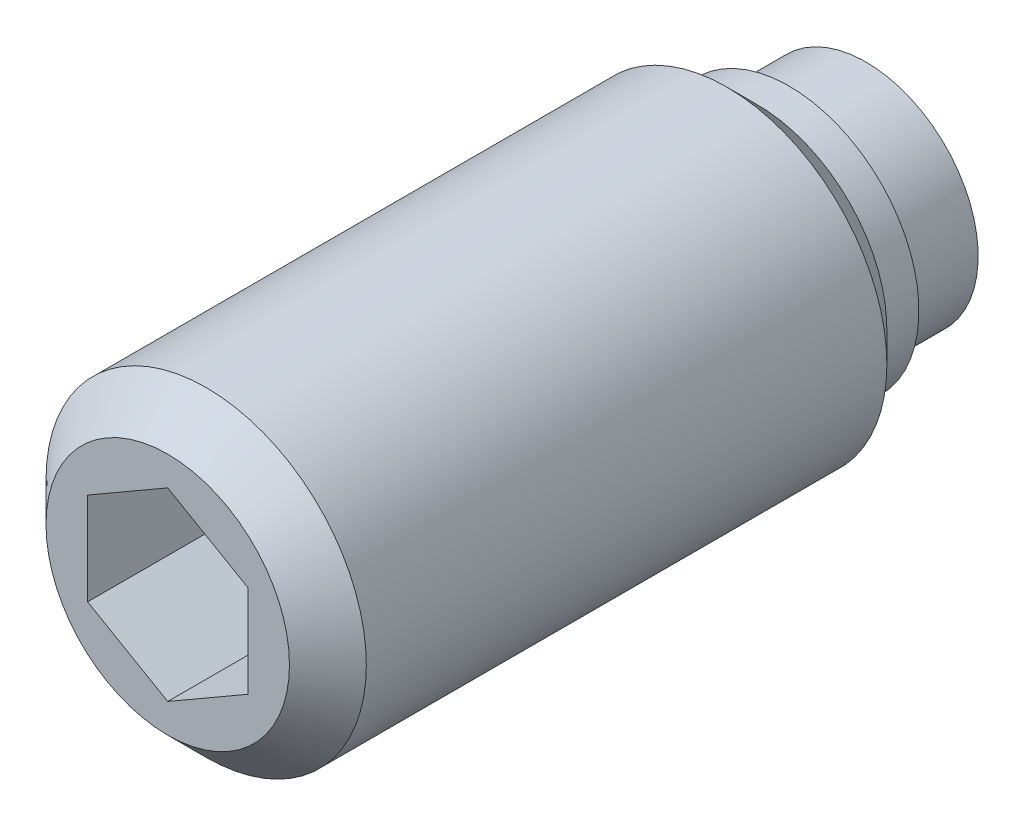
ISO-10303-21;
HEADER;
FILE_DESCRIPTION(('STEP AP214'),'2;1');
FILE_NAME('part.step','',(''),(''),'','','');
FILE_SCHEMA(('AUTOMOTIVE_DESIGN { 1 0 10303 214 1 1 1 1 }'));
ENDSEC;
DATA;
#1=APPLICATION_CONTEXT('core data for automotive mechanical design processes');
#2=APPLICATION_PROTOCOL_DEFINITION('international standard','automotive_design',2000,#1);
#3=PRODUCT_CONTEXT('',#1,'mechanical');
#4=PRODUCT('Part','Part','',(#3));
#5=PRODUCT_RELATED_PRODUCT_CATEGORY('part','',(#4));
#6=PRODUCT_DEFINITION_FORMATION('','',#4);
#7=PRODUCT_DEFINITION_CONTEXT('part definition',#1,'design');
#8=PRODUCT_DEFINITION('design','',#6,#7);
#9=PRODUCT_DEFINITION_SHAPE('','',#8);
#10=(LENGTH_UNIT() NAMED_UNIT(*) SI_UNIT(.MILLI.,.METRE.));
#11=(NAMED_UNIT(*) PLANE_ANGLE_UNIT() SI_UNIT($,.RADIAN.));
#12=(NAMED_UNIT(*) SI_UNIT($,.STERADIAN.) SOLID_ANGLE_UNIT());
#13=UNCERTAINTY_MEASURE_WITH_UNIT(LENGTH_MEASURE(1.E-05),#10,'distance_accuracy_value','');
#14=(GEOMETRIC_REPRESENTATION_CONTEXT(3) GLOBAL_UNCERTAINTY_ASSIGNED_CONTEXT((#13)) GLOBAL_UNIT_ASSIGNED_CONTEXT((#10,
#11,#12)) REPRESENTATION_CONTEXT('',''));
#15=CARTESIAN_POINT('',(0.,0.,0.));
#16=DIRECTION('',(0.,0.,1.));
#17=DIRECTION('',(1.,0.,0.));
#18=AXIS2_PLACEMENT_3D('',#15,#16,#17);
#19=CARTESIAN_POINT('',(0.,4.05,3.5));
#20=DIRECTION('',(0.,0.,1.));
#21=DIRECTION('',(1.,0.,0.));
#22=AXIS2_PLACEMENT_3D('',#19,#20,#21);
#23=PLANE('',#22);
#24=CARTESIAN_POINT('',(0.,0.,3.5));
#25=DIRECTION('',(0.,0.,-1.));
#26=DIRECTION('',(-1.,0.,0.));
#27=AXIS2_PLACEMENT_3D('',#24,#25,#26);
#28=CIRCLE('',#27,3.5);
#29=CARTESIAN_POINT('',(-3.50000000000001,0.,3.5));
#30=VERTEX_POINT('',#29);
#31=EDGE_CURVE('E124',#30,#30,#28,.T.);
#32=ORIENTED_EDGE('',*,*,#31,.F.);
#33=EDGE_LOOP('',(#32));
#34=FACE_BOUND('',#33,.T.);
#35=CARTESIAN_POINT('',(0.,0.,3.5));
#36=DIRECTION('',(0.,0.,-1.));
#37=DIRECTION('',(-1.,0.,0.));
#38=AXIS2_PLACEMENT_3D('',#35,#36,#37);
#39=CIRCLE('',#38,4.05);
#40=CARTESIAN_POINT('',(-4.05000000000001,0.,3.5));
#41=VERTEX_POINT('',#40);
#42=EDGE_CURVE('E127',#41,#41,#39,.T.);
#43=ORIENTED_EDGE('',*,*,#42,.T.);
#44=EDGE_LOOP('',(#43));
#45=FACE_BOUND('',#44,.T.);
#46=ADVANCED_FACE('F14',(#34,#45),#23,.F.);
#47=CARTESIAN_POINT('',(0.,0.,3.5));
#48=DIRECTION('',(0.,0.,-1.));
#49=DIRECTION('',(-1.,0.,0.));
#50=AXIS2_PLACEMENT_3D('',#47,#48,#49);
#51=CYLINDRICAL_SURFACE('',#50,5.);
#52=CARTESIAN_POINT('',(0.,0.,21.7));
#53=DIRECTION('',(0.,0.,1.));
#54=DIRECTION('',(1.,0.,0.));
#55=AXIS2_PLACEMENT_3D('',#52,#53,#54);
#56=CIRCLE('',#55,5.);
#57=CARTESIAN_POINT('',(4.99999999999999,0.,21.7));
#58=VERTEX_POINT('',#57);
#59=EDGE_CURVE('E9',#58,#58,#56,.F.);
#60=ORIENTED_EDGE('',*,*,#59,.T.);
#61=EDGE_LOOP('',(#60));
#62=FACE_BOUND('',#61,.T.);
#63=CARTESIAN_POINT('',(0.,0.,5.45));
#64=DIRECTION('',(0.,0.,-1.));
#65=DIRECTION('',(-1.,0.,0.));
#66=AXIS2_PLACEMENT_3D('',#63,#64,#65);
#67=CIRCLE('',#66,5.);
#68=CARTESIAN_POINT('',(-5.00000000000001,0.,5.45));
#69=VERTEX_POINT('',#68);
#70=EDGE_CURVE('E133',#69,#69,#67,.T.);
#71=ORIENTED_EDGE('',*,*,#70,.F.);
#72=EDGE_LOOP('',(#71));
#73=FACE_BOUND('',#72,.T.);
#74=ADVANCED_FACE('F151',(#62,#73),#51,.T.);
#75=CARTESIAN_POINT('',(0.,0.,5.45));
#76=DIRECTION('',(0.,0.,1.));
#77=DIRECTION('',(1.,0.,0.));
#78=AXIS2_PLACEMENT_3D('',#75,#76,#77);
#79=CONICAL_SURFACE('',#78,5.,0.785398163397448);
#80=CARTESIAN_POINT('',(0.,0.,4.5));
#81=DIRECTION('',(0.,0.,-1.));
#82=DIRECTION('',(-1.,0.,0.));
#83=AXIS2_PLACEMENT_3D('',#80,#81,#82);
#84=CIRCLE('',#83,4.05);
#85=CARTESIAN_POINT('',(-4.05000000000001,0.,4.5));
#86=VERTEX_POINT('',#85);
#87=EDGE_CURVE('E130',#86,#86,#84,.T.);
#88=ORIENTED_EDGE('',*,*,#87,.F.);
#89=EDGE_LOOP('',(#88));
#90=FACE_BOUND('',#89,.T.);
#91=ORIENTED_EDGE('',*,*,#70,.T.);
#92=EDGE_LOOP('',(#91));
#93=FACE_BOUND('',#92,.T.);
#94=ADVANCED_FACE('F158',(#90,#93),#79,.T.);
#95=CARTESIAN_POINT('',(0.,0.,3.5));
#96=DIRECTION('',(0.,0.,-1.));
#97=DIRECTION('',(-1.,0.,0.));
#98=AXIS2_PLACEMENT_3D('',#95,#96,#97);
#99=CYLINDRICAL_SURFACE('',#98,4.05);
#100=ORIENTED_EDGE('',*,*,#42,.F.);
#101=EDGE_LOOP('',(#100));
#102=FACE_BOUND('',#101,.T.);
#103=ORIENTED_EDGE('',*,*,#87,.T.);
#104=EDGE_LOOP('',(#103));
#105=FACE_BOUND('',#104,.T.);
#106=ADVANCED_FACE('F166',(#102,#105),#99,.T.);
#107=CARTESIAN_POINT('',(0.,0.,0.));
#108=DIRECTION('',(0.,0.,-1.));
#109=DIRECTION('',(-1.,0.,0.));
#110=AXIS2_PLACEMENT_3D('',#107,#108,#109);
#111=CYLINDRICAL_SURFACE('',#110,3.5);
#112=CARTESIAN_POINT('',(0.,0.,1.1));
#113=DIRECTION('',(0.,0.,-1.));
#114=DIRECTION('',(-1.,0.,0.));
#115=AXIS2_PLACEMENT_3D('',#112,#113,#114);
#116=CIRCLE('',#115,3.5);
#117=CARTESIAN_POINT('',(-3.50000000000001,0.,1.1));
#118=VERTEX_POINT('',#117);
#119=EDGE_CURVE('E114',#118,#118,#116,.T.);
#120=ORIENTED_EDGE('',*,*,#119,.F.);
#121=EDGE_LOOP('',(#120));
#122=FACE_BOUND('',#121,.T.);
#123=ORIENTED_EDGE('',*,*,#31,.T.);
#124=EDGE_LOOP('',(#123));
#125=FACE_BOUND('',#124,.T.);
#126=ADVANCED_FACE('F164',(#122,#125),#111,.T.);
#127=CARTESIAN_POINT('',(-0.0371790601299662,0.,5.9998848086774));
#128=DIRECTION('',(0.,-1.,0.));
#129=DIRECTION('',(-1.,0.,0.));
#130=AXIS2_PLACEMENT_3D('',#127,#128,#129);
#131=CIRCLE('',#130,5.99999999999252);
#132=TRIMMED_CURVE('',#131,(PARAMETER_VALUE(-1.57699287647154)),
(PARAMETER_VALUE(1.57699287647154)),.T.,.PARAMETER.);
#133=CARTESIAN_POINT('',(0.,0.,5.9998848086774));
#134=DIRECTION('',(0.,0.,-1.));
#135=AXIS1_PLACEMENT('',#133,#134);
#136=SURFACE_OF_REVOLUTION('',#132,#135);
#137=ORIENTED_EDGE('',*,*,#119,.T.);
#138=EDGE_LOOP('',(#137));
#139=FACE_BOUND('',#138,.T.);
#140=CARTESIAN_POINT('',(0.,0.,0.));
#141=VERTEX_POINT('',#140);
#142=VERTEX_LOOP('',#141);
#143=FACE_BOUND('',#142,.T.);
#144=ADVANCED_FACE('F198',(#139,#143),#136,.T.);
#145=CARTESIAN_POINT('',(0.,0.,22.9));
#146=DIRECTION('',(0.,0.,1.));
#147=DIRECTION('',(1.,0.,0.));
#148=AXIS2_PLACEMENT_3D('',#145,#146,#147);
#149=PLANE('',#148);
#150=CARTESIAN_POINT('',(0.,0.,22.9));
#151=DIRECTION('',(0.,0.,1.));
#152=DIRECTION('',(1.,0.,0.));
#153=AXIS2_PLACEMENT_3D('',#150,#151,#152);
#154=CIRCLE('',#153,3.8);
#155=CARTESIAN_POINT('',(3.79999999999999,0.,22.9));
#156=VERTEX_POINT('',#155);
#157=EDGE_CURVE('E22',#156,#156,#154,.T.);
#158=ORIENTED_EDGE('',*,*,#157,.T.);
#159=EDGE_LOOP('',(#158));
#160=FACE_BOUND('',#159,.T.);
#161=DIRECTION('',(-0.866025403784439,0.5,0.));
#162=VECTOR('',#161,1.);
#163=CARTESIAN_POINT('',(2.5,1.44337567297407,22.9));
#164=LINE('',#163,#162);
#165=CARTESIAN_POINT('',(2.5,1.44337567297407,22.9));
#166=VERTEX_POINT('',#165);
#167=CARTESIAN_POINT('',(0.,2.88675134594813,22.9));
#168=VERTEX_POINT('',#167);
#169=EDGE_CURVE('E29',#166,#168,#164,.T.);
#170=ORIENTED_EDGE('',*,*,#169,.F.);
#171=DIRECTION('',(0.,1.,0.));
#172=VECTOR('',#171,1.);
#173=CARTESIAN_POINT('',(2.5,-1.44337567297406,22.9));
#174=LINE('',#173,#172);
#175=CARTESIAN_POINT('',(2.5,-1.44337567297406,22.9));
#176=VERTEX_POINT('',#175);
#177=EDGE_CURVE('E88',#176,#166,#174,.T.);
#178=ORIENTED_EDGE('',*,*,#177,.F.);
#179=DIRECTION('',(0.866025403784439,0.5,0.));
#180=VECTOR('',#179,1.);
#181=CARTESIAN_POINT('',(0.,-2.88675134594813,22.9));
#182=LINE('',#181,#180);
#183=CARTESIAN_POINT('',(0.,-2.88675134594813,22.9));
#184=VERTEX_POINT('',#183);
#185=EDGE_CURVE('E91',#184,#176,#182,.T.);
#186=ORIENTED_EDGE('',*,*,#185,.F.);
#187=DIRECTION('',(0.866025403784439,-0.5,0.));
#188=VECTOR('',#187,1.);
#189=CARTESIAN_POINT('',(-2.5,-1.44337567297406,22.9));
#190=LINE('',#189,#188);
#191=CARTESIAN_POINT('',(-2.5,-1.44337567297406,22.9));
#192=VERTEX_POINT('',#191);
#193=EDGE_CURVE('E107',#192,#184,#190,.T.);
#194=ORIENTED_EDGE('',*,*,#193,.F.);
#195=DIRECTION('',(0.,-1.,0.));
#196=VECTOR('',#195,1.);
#197=CARTESIAN_POINT('',(-2.5,1.44337567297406,22.9));
#198=LINE('',#197,#196);
#199=CARTESIAN_POINT('',(-2.5,1.44337567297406,22.9));
#200=VERTEX_POINT('',#199);
#201=EDGE_CURVE('E104',#200,#192,#198,.T.);
#202=ORIENTED_EDGE('',*,*,#201,.F.);
#203=DIRECTION('',(-0.866025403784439,-0.5,0.));
#204=VECTOR('',#203,1.);
#205=CARTESIAN_POINT('',(0.,2.88675134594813,22.9));
#206=LINE('',#205,#204);
#207=EDGE_CURVE('E102',#168,#200,#206,.T.);
#208=ORIENTED_EDGE('',*,*,#207,.F.);
#209=EDGE_LOOP('',(#170,#178,#186,#194,#202,#208));
#210=FACE_BOUND('',#209,.T.);
#211=ADVANCED_FACE('F138',(#160,#210),#149,.T.);
#212=CARTESIAN_POINT('',(2.5,1.44337567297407,16.9));
#213=DIRECTION('',(0.5,0.866025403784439,0.));
#214=DIRECTION('',(-0.866025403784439,0.5,0.));
#215=AXIS2_PLACEMENT_3D('',#212,#213,#214);
#216=PLANE('',#215);
#217=ORIENTED_EDGE('',*,*,#169,.T.);
#218=DIRECTION('',(0.,0.,1.));
#219=VECTOR('',#218,1.);
#220=CARTESIAN_POINT('',(0.,2.88675134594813,16.9));
#221=LINE('',#220,#219);
#222=CARTESIAN_POINT('',(0.,2.88675134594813,16.9));
#223=VERTEX_POINT('',#222);
#224=EDGE_CURVE('E65',#223,#168,#221,.T.);
#225=ORIENTED_EDGE('',*,*,#224,.F.);
#226=DIRECTION('',(-0.866025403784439,0.5,0.));
#227=VECTOR('',#226,1.);
#228=CARTESIAN_POINT('',(2.5,1.44337567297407,16.9));
#229=LINE('',#228,#227);
#230=CARTESIAN_POINT('',(2.5,1.44337567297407,16.9));
#231=VERTEX_POINT('',#230);
#232=EDGE_CURVE('E69',#231,#223,#229,.T.);
#233=ORIENTED_EDGE('',*,*,#232,.F.);
#234=DIRECTION('',(0.,0.,1.));
#235=VECTOR('',#234,1.);
#236=CARTESIAN_POINT('',(2.5,1.44337567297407,16.9));
#237=LINE('',#236,#235);
#238=EDGE_CURVE('E112',#231,#166,#237,.T.);
#239=ORIENTED_EDGE('',*,*,#238,.T.);
#240=EDGE_LOOP('',(#217,#225,#233,#239));
#241=FACE_BOUND('',#240,.T.);
#242=ADVANCED_FACE('F67',(#241),#216,.F.);
#243=CARTESIAN_POINT('',(2.5,-1.44337567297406,16.9));
#244=DIRECTION('',(1.,0.,0.));
#245=DIRECTION('',(0.,0.,-1.));
#246=AXIS2_PLACEMENT_3D('',#243,#244,#245);
#247=PLANE('',#246);
#248=ORIENTED_EDGE('',*,*,#177,.T.);
#249=ORIENTED_EDGE('',*,*,#238,.F.);
#250=DIRECTION('',(0.,1.,0.));
#251=VECTOR('',#250,1.);
#252=CARTESIAN_POINT('',(2.5,-1.44337567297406,16.9));
#253=LINE('',#252,#251);
#254=CARTESIAN_POINT('',(2.5,-1.44337567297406,16.9));
#255=VERTEX_POINT('',#254);
#256=EDGE_CURVE('E75',#255,#231,#253,.T.);
#257=ORIENTED_EDGE('',*,*,#256,.F.);
#258=DIRECTION('',(0.,0.,1.));
#259=VECTOR('',#258,1.);
#260=CARTESIAN_POINT('',(2.5,-1.44337567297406,16.9));
#261=LINE('',#260,#259);
#262=EDGE_CURVE('E115',#255,#176,#261,.T.);
#263=ORIENTED_EDGE('',*,*,#262,.T.);
#264=EDGE_LOOP('',(#248,#249,#257,#263));
#265=FACE_BOUND('',#264,.T.);
#266=ADVANCED_FACE('F220',(#265),#247,.F.);
#267=CARTESIAN_POINT('',(0.,-2.88675134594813,16.9));
#268=DIRECTION('',(0.5,-0.866025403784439,0.));
#269=DIRECTION('',(0.866025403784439,0.5,0.));
#270=AXIS2_PLACEMENT_3D('',#267,#268,#269);
#271=PLANE('',#270);
#272=ORIENTED_EDGE('',*,*,#185,.T.);
#273=ORIENTED_EDGE('',*,*,#262,.F.);
#274=DIRECTION('',(0.866025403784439,0.5,0.));
#275=VECTOR('',#274,1.);
#276=CARTESIAN_POINT('',(0.,-2.88675134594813,16.9));
#277=LINE('',#276,#275);
#278=CARTESIAN_POINT('',(0.,-2.88675134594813,16.9));
#279=VERTEX_POINT('',#278);
#280=EDGE_CURVE('E98',#279,#255,#277,.T.);
#281=ORIENTED_EDGE('',*,*,#280,.F.);
#282=DIRECTION('',(0.,0.,1.));
#283=VECTOR('',#282,1.);
#284=CARTESIAN_POINT('',(0.,-2.88675134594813,16.9));
#285=LINE('',#284,#283);
#286=EDGE_CURVE('E117',#279,#184,#285,.T.);
#287=ORIENTED_EDGE('',*,*,#286,.T.);
#288=EDGE_LOOP('',(#272,#273,#281,#287));
#289=FACE_BOUND('',#288,.T.);
#290=ADVANCED_FACE('F228',(#289),#271,.F.);
#291=CARTESIAN_POINT('',(-2.5,-1.44337567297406,16.9));
#292=DIRECTION('',(-0.5,-0.866025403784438,0.));
#293=DIRECTION('',(0.866025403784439,-0.5,0.));
#294=AXIS2_PLACEMENT_3D('',#291,#292,#293);
#295=PLANE('',#294);
#296=ORIENTED_EDGE('',*,*,#193,.T.);
#297=ORIENTED_EDGE('',*,*,#286,.F.);
#298=DIRECTION('',(0.866025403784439,-0.5,0.));
#299=VECTOR('',#298,1.);
#300=CARTESIAN_POINT('',(-2.5,-1.44337567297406,16.9));
#301=LINE('',#300,#299);
#302=CARTESIAN_POINT('',(-2.5,-1.44337567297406,16.9));
#303=VERTEX_POINT('',#302);
#304=EDGE_CURVE('E95',#303,#279,#301,.T.);
#305=ORIENTED_EDGE('',*,*,#304,.F.);
#306=DIRECTION('',(0.,0.,1.));
#307=VECTOR('',#306,1.);
#308=CARTESIAN_POINT('',(-2.5,-1.44337567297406,16.9));
#309=LINE('',#308,#307);
#310=EDGE_CURVE('E119',#303,#192,#309,.T.);
#311=ORIENTED_EDGE('',*,*,#310,.T.);
#312=EDGE_LOOP('',(#296,#297,#305,#311));
#313=FACE_BOUND('',#312,.T.);
#314=ADVANCED_FACE('F237',(#313),#295,.F.);
#315=CARTESIAN_POINT('',(-2.5,1.44337567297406,16.9));
#316=DIRECTION('',(-1.,0.,0.));
#317=DIRECTION('',(0.,0.,1.));
#318=AXIS2_PLACEMENT_3D('',#315,#316,#317);
#319=PLANE('',#318);
#320=ORIENTED_EDGE('',*,*,#201,.T.);
#321=ORIENTED_EDGE('',*,*,#310,.F.);
#322=DIRECTION('',(0.,-1.,0.));
#323=VECTOR('',#322,1.);
#324=CARTESIAN_POINT('',(-2.5,1.44337567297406,16.9));
#325=LINE('',#324,#323);
#326=CARTESIAN_POINT('',(-2.5,1.44337567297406,16.9));
#327=VERTEX_POINT('',#326);
#328=EDGE_CURVE('E83',#327,#303,#325,.T.);
#329=ORIENTED_EDGE('',*,*,#328,.F.);
#330=DIRECTION('',(0.,0.,1.));
#331=VECTOR('',#330,1.);
#332=CARTESIAN_POINT('',(-2.5,1.44337567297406,16.9));
#333=LINE('',#332,#331);
#334=EDGE_CURVE('E74',#327,#200,#333,.T.);
#335=ORIENTED_EDGE('',*,*,#334,.T.);
#336=EDGE_LOOP('',(#320,#321,#329,#335));
#337=FACE_BOUND('',#336,.T.);
#338=ADVANCED_FACE('F246',(#337),#319,.F.);
#339=CARTESIAN_POINT('',(0.,2.88675134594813,16.9));
#340=DIRECTION('',(-0.5,0.866025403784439,0.));
#341=DIRECTION('',(-0.866025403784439,-0.5,0.));
#342=AXIS2_PLACEMENT_3D('',#339,#340,#341);
#343=PLANE('',#342);
#344=ORIENTED_EDGE('',*,*,#207,.T.);
#345=ORIENTED_EDGE('',*,*,#334,.F.);
#346=DIRECTION('',(-0.866025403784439,-0.5,0.));
#347=VECTOR('',#346,1.);
#348=CARTESIAN_POINT('',(0.,2.88675134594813,16.9));
#349=LINE('',#348,#347);
#350=EDGE_CURVE('E78',#223,#327,#349,.T.);
#351=ORIENTED_EDGE('',*,*,#350,.F.);
#352=ORIENTED_EDGE('',*,*,#224,.T.);
#353=EDGE_LOOP('',(#344,#345,#351,#352));
#354=FACE_BOUND('',#353,.T.);
#355=ADVANCED_FACE('F79',(#354),#343,.F.);
#356=CARTESIAN_POINT('',(0.,0.,16.9));
#357=DIRECTION('',(0.,0.,1.));
#358=DIRECTION('',(1.,0.,0.));
#359=AXIS2_PLACEMENT_3D('',#356,#357,#358);
#360=PLANE('',#359);
#361=ORIENTED_EDGE('',*,*,#232,.T.);
#362=ORIENTED_EDGE('',*,*,#350,.T.);
#363=ORIENTED_EDGE('',*,*,#328,.T.);
#364=ORIENTED_EDGE('',*,*,#304,.T.);
#365=ORIENTED_EDGE('',*,*,#280,.T.);
#366=ORIENTED_EDGE('',*,*,#256,.T.);
#367=EDGE_LOOP('',(#361,#362,#363,#364,#365,#366));
#368=FACE_BOUND('',#367,.T.);
#369=ADVANCED_FACE('F85',(#368),#360,.T.);
#370=CARTESIAN_POINT('',(0.,0.,22.9));
#371=DIRECTION('',(0.,0.,-1.));
#372=DIRECTION('',(-1.,0.,0.));
#373=AXIS2_PLACEMENT_3D('',#370,#371,#372);
#374=CONICAL_SURFACE('',#373,3.8,0.785398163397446);
#375=ORIENTED_EDGE('',*,*,#59,.F.);
#376=EDGE_LOOP('',(#375));
#377=FACE_BOUND('',#376,.T.);
#378=ORIENTED_EDGE('',*,*,#157,.F.);
#379=EDGE_LOOP('',(#378));
#380=FACE_BOUND('',#379,.T.);
#381=ADVANCED_FACE('F16',(#377,#380),#374,.T.);
#382=CLOSED_SHELL('',(#46,#74,#94,#106,#126,#144,#211,#242,#266,#290,#314,#338,#355,#369,#381));
#383=MANIFOLD_SOLID_BREP('B1',#382);
#384=ADVANCED_BREP_SHAPE_REPRESENTATION('',(#18,#383),#14);
#385=SHAPE_DEFINITION_REPRESENTATION(#9,#384);
ENDSEC;
END-ISO-10303-21;
